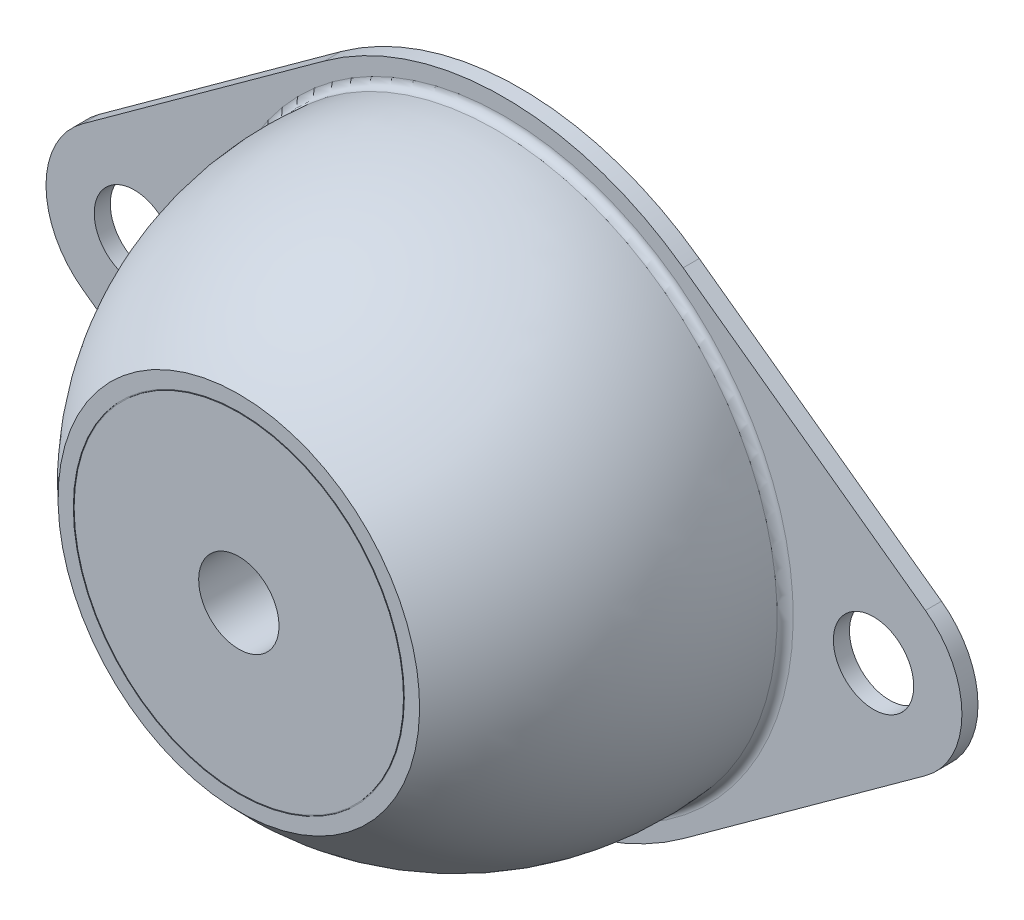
ISO-10303-21;
HEADER;
FILE_DESCRIPTION(('STEP AP214'),'2;1');
FILE_NAME('part.step','',(''),(''),'','','');
FILE_SCHEMA(('AUTOMOTIVE_DESIGN { 1 0 10303 214 1 1 1 1 }'));
ENDSEC;
DATA;
#1=APPLICATION_CONTEXT('core data for automotive mechanical design processes');
#2=APPLICATION_PROTOCOL_DEFINITION('international standard','automotive_design',2000,#1);
#3=PRODUCT_CONTEXT('',#1,'mechanical');
#4=PRODUCT('Part','Part','',(#3));
#5=PRODUCT_RELATED_PRODUCT_CATEGORY('part','',(#4));
#6=PRODUCT_DEFINITION_FORMATION('','',#4);
#7=PRODUCT_DEFINITION_CONTEXT('part definition',#1,'design');
#8=PRODUCT_DEFINITION('design','',#6,#7);
#9=PRODUCT_DEFINITION_SHAPE('','',#8);
#10=(LENGTH_UNIT() NAMED_UNIT(*) SI_UNIT(.MILLI.,.METRE.));
#11=(NAMED_UNIT(*) PLANE_ANGLE_UNIT() SI_UNIT($,.RADIAN.));
#12=(NAMED_UNIT(*) SI_UNIT($,.STERADIAN.) SOLID_ANGLE_UNIT());
#13=UNCERTAINTY_MEASURE_WITH_UNIT(LENGTH_MEASURE(1.E-05),#10,'distance_accuracy_value','');
#14=(GEOMETRIC_REPRESENTATION_CONTEXT(3) GLOBAL_UNCERTAINTY_ASSIGNED_CONTEXT((#13)) GLOBAL_UNIT_ASSIGNED_CONTEXT((#10,
#11,#12)) REPRESENTATION_CONTEXT('',''));
#15=CARTESIAN_POINT('',(0.,0.,0.));
#16=DIRECTION('',(0.,0.,1.));
#17=DIRECTION('',(1.,0.,0.));
#18=AXIS2_PLACEMENT_3D('',#15,#16,#17);
#19=CARTESIAN_POINT('',(0.,0.,2.));
#20=DIRECTION('',(0.,0.,1.));
#21=DIRECTION('',(0.,-1.,0.));
#22=AXIS2_PLACEMENT_3D('',#19,#20,#21);
#23=PLANE('',#22);
#24=DIRECTION('',(-0.809618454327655,-0.586956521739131,0.));
#25=VECTOR('',#24,1.);
#26=CARTESIAN_POINT('',(23.695652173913,30.7655012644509,2.));
#27=LINE('',#26,#25);
#28=CARTESIAN_POINT('',(23.695652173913,30.7655012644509,2.));
#29=VERTEX_POINT('',#28);
#30=CARTESIAN_POINT('',(-6.4565217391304,8.90580299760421,2.));
#31=VERTEX_POINT('',#30);
#32=EDGE_CURVE('E141',#29,#31,#27,.T.);
#33=ORIENTED_EDGE('',*,*,#32,.T.);
#34=CARTESIAN_POINT('',(0.,0.,2.));
#35=DIRECTION('',(0.,0.,1.));
#36=DIRECTION('',(1.,0.,0.));
#37=AXIS2_PLACEMENT_3D('',#34,#35,#36);
#38=CIRCLE('',#37,11.);
#39=CARTESIAN_POINT('',(-6.4565217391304,-8.90580299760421,2.));
#40=VERTEX_POINT('',#39);
#41=EDGE_CURVE('E74',#31,#40,#38,.T.);
#42=ORIENTED_EDGE('',*,*,#41,.T.);
#43=DIRECTION('',(0.809618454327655,-0.586956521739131,0.));
#44=VECTOR('',#43,1.);
#45=CARTESIAN_POINT('',(-6.4565217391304,-8.90580299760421,2.));
#46=LINE('',#45,#44);
#47=CARTESIAN_POINT('',(23.695652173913,-30.7655012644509,2.));
#48=VERTEX_POINT('',#47);
#49=EDGE_CURVE('E156',#40,#48,#46,.T.);
#50=ORIENTED_EDGE('',*,*,#49,.T.);
#51=CARTESIAN_POINT('',(46.,0.,2.));
#52=DIRECTION('',(0.,0.,1.));
#53=DIRECTION('',(1.,0.,0.));
#54=AXIS2_PLACEMENT_3D('',#51,#52,#53);
#55=CIRCLE('',#54,38.);
#56=CARTESIAN_POINT('',(68.3043478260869,-30.765501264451,2.));
#57=VERTEX_POINT('',#56);
#58=EDGE_CURVE('E169',#48,#57,#55,.T.);
#59=ORIENTED_EDGE('',*,*,#58,.T.);
#60=DIRECTION('',(0.809618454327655,0.586956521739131,0.));
#61=VECTOR('',#60,1.);
#62=CARTESIAN_POINT('',(68.304347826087,-30.7655012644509,2.));
#63=LINE('',#62,#61);
#64=CARTESIAN_POINT('',(98.4565217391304,-8.90580299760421,2.));
#65=VERTEX_POINT('',#64);
#66=EDGE_CURVE('E93',#57,#65,#63,.T.);
#67=ORIENTED_EDGE('',*,*,#66,.T.);
#68=CARTESIAN_POINT('',(92.,0.,2.));
#69=DIRECTION('',(0.,0.,1.));
#70=DIRECTION('',(1.,0.,0.));
#71=AXIS2_PLACEMENT_3D('',#68,#69,#70);
#72=CIRCLE('',#71,11.);
#73=CARTESIAN_POINT('',(98.4565217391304,8.90580299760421,2.));
#74=VERTEX_POINT('',#73);
#75=EDGE_CURVE('E87',#65,#74,#72,.T.);
#76=ORIENTED_EDGE('',*,*,#75,.T.);
#77=DIRECTION('',(-0.809618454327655,0.586956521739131,0.));
#78=VECTOR('',#77,1.);
#79=CARTESIAN_POINT('',(98.4565217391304,8.90580299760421,2.));
#80=LINE('',#79,#78);
#81=CARTESIAN_POINT('',(68.304347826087,30.7655012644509,2.));
#82=VERTEX_POINT('',#81);
#83=EDGE_CURVE('E91',#74,#82,#80,.T.);
#84=ORIENTED_EDGE('',*,*,#83,.T.);
#85=CARTESIAN_POINT('',(46.,0.,2.));
#86=DIRECTION('',(0.,0.,1.));
#87=DIRECTION('',(1.,0.,0.));
#88=AXIS2_PLACEMENT_3D('',#85,#86,#87);
#89=CIRCLE('',#88,38.);
#90=EDGE_CURVE('E31',#82,#29,#89,.T.);
#91=ORIENTED_EDGE('',*,*,#90,.T.);
#92=EDGE_LOOP('',(#33,#42,#50,#59,#67,#76,#84,#91));
#93=FACE_BOUND('',#92,.T.);
#94=CARTESIAN_POINT('',(92.,0.,2.));
#95=DIRECTION('',(0.,0.,1.));
#96=DIRECTION('',(1.,0.,0.));
#97=AXIS2_PLACEMENT_3D('',#94,#95,#96);
#98=CIRCLE('',#97,5.);
#99=CARTESIAN_POINT('',(97.,0.,2.));
#100=VERTEX_POINT('',#99);
#101=EDGE_CURVE('E107',#100,#100,#98,.T.);
#102=ORIENTED_EDGE('',*,*,#101,.F.);
#103=EDGE_LOOP('',(#102));
#104=FACE_BOUND('',#103,.T.);
#105=CARTESIAN_POINT('',(0.,0.,2.));
#106=DIRECTION('',(0.,0.,1.));
#107=DIRECTION('',(1.,0.,0.));
#108=AXIS2_PLACEMENT_3D('',#105,#106,#107);
#109=CIRCLE('',#108,5.);
#110=CARTESIAN_POINT('',(5.,0.,2.));
#111=VERTEX_POINT('',#110);
#112=EDGE_CURVE('E113',#111,#111,#109,.T.);
#113=ORIENTED_EDGE('',*,*,#112,.F.);
#114=EDGE_LOOP('',(#113));
#115=FACE_BOUND('',#114,.T.);
#116=CARTESIAN_POINT('',(46.,0.,2.));
#117=DIRECTION('',(0.,0.,-1.));
#118=DIRECTION('',(0.,1.,0.));
#119=AXIS2_PLACEMENT_3D('',#116,#117,#118);
#120=CIRCLE('',#119,36.);
#121=CARTESIAN_POINT('',(46.,36.,2.));
#122=VERTEX_POINT('',#121);
#123=EDGE_CURVE('E192',#122,#122,#120,.T.);
#124=ORIENTED_EDGE('',*,*,#123,.T.);
#125=EDGE_LOOP('',(#124));
#126=FACE_BOUND('',#125,.T.);
#127=ADVANCED_FACE('F14',(#93,#104,#115,#126),#23,.T.);
#128=CARTESIAN_POINT('',(23.695652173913,30.7655012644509,2.));
#129=DIRECTION('',(0.58695652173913,-0.809618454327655,0.));
#130=DIRECTION('',(0.809618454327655,0.58695652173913,0.));
#131=AXIS2_PLACEMENT_3D('',#128,#129,#130);
#132=PLANE('',#131);
#133=DIRECTION('',(-0.809618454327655,-0.586956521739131,0.));
#134=VECTOR('',#133,1.);
#135=CARTESIAN_POINT('',(23.695652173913,30.7655012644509,0.));
#136=LINE('',#135,#134);
#137=CARTESIAN_POINT('',(23.695652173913,30.7655012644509,0.));
#138=VERTEX_POINT('',#137);
#139=CARTESIAN_POINT('',(-6.4565217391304,8.90580299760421,0.));
#140=VERTEX_POINT('',#139);
#141=EDGE_CURVE('E117',#138,#140,#136,.T.);
#142=ORIENTED_EDGE('',*,*,#141,.T.);
#143=DIRECTION('',(0.,0.,-1.));
#144=VECTOR('',#143,1.);
#145=CARTESIAN_POINT('',(-6.4565217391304,8.90580299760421,2.));
#146=LINE('',#145,#144);
#147=EDGE_CURVE('E9',#31,#140,#146,.T.);
#148=ORIENTED_EDGE('',*,*,#147,.F.);
#149=ORIENTED_EDGE('',*,*,#32,.F.);
#150=DIRECTION('',(0.,0.,-1.));
#151=VECTOR('',#150,1.);
#152=CARTESIAN_POINT('',(23.695652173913,30.7655012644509,2.));
#153=LINE('',#152,#151);
#154=EDGE_CURVE('E116',#29,#138,#153,.T.);
#155=ORIENTED_EDGE('',*,*,#154,.T.);
#156=EDGE_LOOP('',(#142,#148,#149,#155));
#157=FACE_BOUND('',#156,.T.);
#158=ADVANCED_FACE('F16',(#157),#132,.F.);
#159=CARTESIAN_POINT('',(0.,0.,2.));
#160=DIRECTION('',(0.,0.,-1.));
#161=DIRECTION('',(0.,1.,0.));
#162=AXIS2_PLACEMENT_3D('',#159,#160,#161);
#163=CYLINDRICAL_SURFACE('',#162,11.);
#164=CARTESIAN_POINT('',(0.,0.,0.));
#165=DIRECTION('',(0.,0.,1.));
#166=DIRECTION('',(1.,0.,0.));
#167=AXIS2_PLACEMENT_3D('',#164,#165,#166);
#168=CIRCLE('',#167,11.);
#169=CARTESIAN_POINT('',(-6.4565217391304,-8.90580299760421,0.));
#170=VERTEX_POINT('',#169);
#171=EDGE_CURVE('E120',#140,#170,#168,.T.);
#172=ORIENTED_EDGE('',*,*,#171,.T.);
#173=DIRECTION('',(0.,0.,-1.));
#174=VECTOR('',#173,1.);
#175=CARTESIAN_POINT('',(-6.4565217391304,-8.90580299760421,2.));
#176=LINE('',#175,#174);
#177=EDGE_CURVE('E23',#40,#170,#176,.T.);
#178=ORIENTED_EDGE('',*,*,#177,.F.);
#179=ORIENTED_EDGE('',*,*,#41,.F.);
#180=ORIENTED_EDGE('',*,*,#147,.T.);
#181=EDGE_LOOP('',(#172,#178,#179,#180));
#182=FACE_BOUND('',#181,.T.);
#183=ADVANCED_FACE('F236',(#182),#163,.T.);
#184=CARTESIAN_POINT('',(-6.4565217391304,-8.90580299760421,2.));
#185=DIRECTION('',(0.586956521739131,0.809618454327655,0.));
#186=DIRECTION('',(-0.809618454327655,0.586956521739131,0.));
#187=AXIS2_PLACEMENT_3D('',#184,#185,#186);
#188=PLANE('',#187);
#189=DIRECTION('',(0.809618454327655,-0.586956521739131,0.));
#190=VECTOR('',#189,1.);
#191=CARTESIAN_POINT('',(-6.4565217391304,-8.90580299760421,0.));
#192=LINE('',#191,#190);
#193=CARTESIAN_POINT('',(23.695652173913,-30.7655012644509,0.));
#194=VERTEX_POINT('',#193);
#195=EDGE_CURVE('E123',#170,#194,#192,.T.);
#196=ORIENTED_EDGE('',*,*,#195,.T.);
#197=DIRECTION('',(0.,0.,-1.));
#198=VECTOR('',#197,1.);
#199=CARTESIAN_POINT('',(23.695652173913,-30.7655012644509,2.));
#200=LINE('',#199,#198);
#201=EDGE_CURVE('E148',#48,#194,#200,.T.);
#202=ORIENTED_EDGE('',*,*,#201,.F.);
#203=ORIENTED_EDGE('',*,*,#49,.F.);
#204=ORIENTED_EDGE('',*,*,#177,.T.);
#205=EDGE_LOOP('',(#196,#202,#203,#204));
#206=FACE_BOUND('',#205,.T.);
#207=ADVANCED_FACE('F154',(#206),#188,.F.);
#208=CARTESIAN_POINT('',(46.,0.,2.));
#209=DIRECTION('',(0.,0.,-1.));
#210=DIRECTION('',(0.,1.,0.));
#211=AXIS2_PLACEMENT_3D('',#208,#209,#210);
#212=CYLINDRICAL_SURFACE('',#211,38.);
#213=CARTESIAN_POINT('',(46.,0.,0.));
#214=DIRECTION('',(0.,0.,1.));
#215=DIRECTION('',(1.,0.,0.));
#216=AXIS2_PLACEMENT_3D('',#213,#214,#215);
#217=CIRCLE('',#216,38.);
#218=CARTESIAN_POINT('',(68.3043478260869,-30.765501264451,0.));
#219=VERTEX_POINT('',#218);
#220=EDGE_CURVE('E125',#194,#219,#217,.T.);
#221=ORIENTED_EDGE('',*,*,#220,.T.);
#222=DIRECTION('',(0.,0.,-1.));
#223=VECTOR('',#222,1.);
#224=CARTESIAN_POINT('',(68.3043478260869,-30.765501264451,2.));
#225=LINE('',#224,#223);
#226=EDGE_CURVE('E145',#57,#219,#225,.T.);
#227=ORIENTED_EDGE('',*,*,#226,.F.);
#228=ORIENTED_EDGE('',*,*,#58,.F.);
#229=ORIENTED_EDGE('',*,*,#201,.T.);
#230=EDGE_LOOP('',(#221,#227,#228,#229));
#231=FACE_BOUND('',#230,.T.);
#232=ADVANCED_FACE('F165',(#231),#212,.T.);
#233=CARTESIAN_POINT('',(68.304347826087,-30.7655012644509,2.));
#234=DIRECTION('',(-0.58695652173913,0.809618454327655,0.));
#235=DIRECTION('',(-0.809618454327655,-0.58695652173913,0.));
#236=AXIS2_PLACEMENT_3D('',#233,#234,#235);
#237=PLANE('',#236);
#238=DIRECTION('',(0.809618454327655,0.586956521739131,0.));
#239=VECTOR('',#238,1.);
#240=CARTESIAN_POINT('',(68.304347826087,-30.7655012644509,0.));
#241=LINE('',#240,#239);
#242=CARTESIAN_POINT('',(98.4565217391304,-8.90580299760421,0.));
#243=VERTEX_POINT('',#242);
#244=EDGE_CURVE('E127',#219,#243,#241,.T.);
#245=ORIENTED_EDGE('',*,*,#244,.T.);
#246=DIRECTION('',(0.,0.,-1.));
#247=VECTOR('',#246,1.);
#248=CARTESIAN_POINT('',(98.4565217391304,-8.90580299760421,2.));
#249=LINE('',#248,#247);
#250=EDGE_CURVE('E102',#65,#243,#249,.T.);
#251=ORIENTED_EDGE('',*,*,#250,.F.);
#252=ORIENTED_EDGE('',*,*,#66,.F.);
#253=ORIENTED_EDGE('',*,*,#226,.T.);
#254=EDGE_LOOP('',(#245,#251,#252,#253));
#255=FACE_BOUND('',#254,.T.);
#256=ADVANCED_FACE('F168',(#255),#237,.F.);
#257=CARTESIAN_POINT('',(92.,0.,2.));
#258=DIRECTION('',(0.,0.,-1.));
#259=DIRECTION('',(0.,1.,0.));
#260=AXIS2_PLACEMENT_3D('',#257,#258,#259);
#261=CYLINDRICAL_SURFACE('',#260,11.);
#262=CARTESIAN_POINT('',(92.,0.,0.));
#263=DIRECTION('',(0.,0.,1.));
#264=DIRECTION('',(1.,0.,0.));
#265=AXIS2_PLACEMENT_3D('',#262,#263,#264);
#266=CIRCLE('',#265,11.);
#267=CARTESIAN_POINT('',(98.4565217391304,8.90580299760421,0.));
#268=VERTEX_POINT('',#267);
#269=EDGE_CURVE('E101',#243,#268,#266,.T.);
#270=ORIENTED_EDGE('',*,*,#269,.T.);
#271=DIRECTION('',(0.,0.,-1.));
#272=VECTOR('',#271,1.);
#273=CARTESIAN_POINT('',(98.4565217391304,8.90580299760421,2.));
#274=LINE('',#273,#272);
#275=EDGE_CURVE('E98',#74,#268,#274,.T.);
#276=ORIENTED_EDGE('',*,*,#275,.F.);
#277=ORIENTED_EDGE('',*,*,#75,.F.);
#278=ORIENTED_EDGE('',*,*,#250,.T.);
#279=EDGE_LOOP('',(#270,#276,#277,#278));
#280=FACE_BOUND('',#279,.T.);
#281=ADVANCED_FACE('F99',(#280),#261,.T.);
#282=CARTESIAN_POINT('',(98.4565217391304,8.90580299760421,2.));
#283=DIRECTION('',(-0.586956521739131,-0.809618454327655,0.));
#284=DIRECTION('',(0.809618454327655,-0.586956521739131,0.));
#285=AXIS2_PLACEMENT_3D('',#282,#283,#284);
#286=PLANE('',#285);
#287=DIRECTION('',(-0.809618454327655,0.586956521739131,0.));
#288=VECTOR('',#287,1.);
#289=CARTESIAN_POINT('',(98.4565217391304,8.90580299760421,0.));
#290=LINE('',#289,#288);
#291=CARTESIAN_POINT('',(68.304347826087,30.7655012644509,0.));
#292=VERTEX_POINT('',#291);
#293=EDGE_CURVE('E60',#268,#292,#290,.T.);
#294=ORIENTED_EDGE('',*,*,#293,.T.);
#295=DIRECTION('',(0.,0.,-1.));
#296=VECTOR('',#295,1.);
#297=CARTESIAN_POINT('',(68.304347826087,30.7655012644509,2.));
#298=LINE('',#297,#296);
#299=EDGE_CURVE('E103',#82,#292,#298,.T.);
#300=ORIENTED_EDGE('',*,*,#299,.F.);
#301=ORIENTED_EDGE('',*,*,#83,.F.);
#302=ORIENTED_EDGE('',*,*,#275,.T.);
#303=EDGE_LOOP('',(#294,#300,#301,#302));
#304=FACE_BOUND('',#303,.T.);
#305=ADVANCED_FACE('F105',(#304),#286,.F.);
#306=CARTESIAN_POINT('',(92.,0.,2.));
#307=DIRECTION('',(0.,0.,-1.));
#308=DIRECTION('',(0.,1.,0.));
#309=AXIS2_PLACEMENT_3D('',#306,#307,#308);
#310=CYLINDRICAL_SURFACE('',#309,5.);
#311=ORIENTED_EDGE('',*,*,#101,.T.);
#312=EDGE_LOOP('',(#311));
#313=FACE_BOUND('',#312,.T.);
#314=CARTESIAN_POINT('',(92.,0.,0.));
#315=DIRECTION('',(0.,0.,1.));
#316=DIRECTION('',(1.,0.,0.));
#317=AXIS2_PLACEMENT_3D('',#314,#315,#316);
#318=CIRCLE('',#317,5.);
#319=CARTESIAN_POINT('',(97.,0.,0.));
#320=VERTEX_POINT('',#319);
#321=EDGE_CURVE('E132',#320,#320,#318,.T.);
#322=ORIENTED_EDGE('',*,*,#321,.F.);
#323=EDGE_LOOP('',(#322));
#324=FACE_BOUND('',#323,.T.);
#325=ADVANCED_FACE('F251',(#313,#324),#310,.F.);
#326=CARTESIAN_POINT('',(46.,0.,2.));
#327=DIRECTION('',(0.,0.,-1.));
#328=DIRECTION('',(0.,1.,0.));
#329=AXIS2_PLACEMENT_3D('',#326,#327,#328);
#330=CYLINDRICAL_SURFACE('',#329,22.5);
#331=CARTESIAN_POINT('',(46.,0.,11.5));
#332=DIRECTION('',(0.,0.,-1.));
#333=DIRECTION('',(0.,1.,0.));
#334=AXIS2_PLACEMENT_3D('',#331,#332,#333);
#335=CIRCLE('',#334,22.5);
#336=CARTESIAN_POINT('',(46.,22.5,11.5));
#337=VERTEX_POINT('',#336);
#338=EDGE_CURVE('E195',#337,#337,#335,.T.);
#339=ORIENTED_EDGE('',*,*,#338,.F.);
#340=EDGE_LOOP('',(#339));
#341=FACE_BOUND('',#340,.T.);
#342=CARTESIAN_POINT('',(46.,0.,0.));
#343=DIRECTION('',(0.,0.,1.));
#344=DIRECTION('',(1.,0.,0.));
#345=AXIS2_PLACEMENT_3D('',#342,#343,#344);
#346=CIRCLE('',#345,22.5);
#347=CARTESIAN_POINT('',(68.5,0.,0.));
#348=VERTEX_POINT('',#347);
#349=EDGE_CURVE('E135',#348,#348,#346,.T.);
#350=ORIENTED_EDGE('',*,*,#349,.F.);
#351=EDGE_LOOP('',(#350));
#352=FACE_BOUND('',#351,.T.);
#353=ADVANCED_FACE('F247',(#341,#352),#330,.F.);
#354=CARTESIAN_POINT('',(0.,0.,2.));
#355=DIRECTION('',(0.,0.,-1.));
#356=DIRECTION('',(0.,1.,0.));
#357=AXIS2_PLACEMENT_3D('',#354,#355,#356);
#358=CYLINDRICAL_SURFACE('',#357,5.);
#359=ORIENTED_EDGE('',*,*,#112,.T.);
#360=EDGE_LOOP('',(#359));
#361=FACE_BOUND('',#360,.T.);
#362=CARTESIAN_POINT('',(0.,0.,0.));
#363=DIRECTION('',(0.,0.,1.));
#364=DIRECTION('',(1.,0.,0.));
#365=AXIS2_PLACEMENT_3D('',#362,#363,#364);
#366=CIRCLE('',#365,5.);
#367=CARTESIAN_POINT('',(5.,0.,0.));
#368=VERTEX_POINT('',#367);
#369=EDGE_CURVE('E138',#368,#368,#366,.T.);
#370=ORIENTED_EDGE('',*,*,#369,.F.);
#371=EDGE_LOOP('',(#370));
#372=FACE_BOUND('',#371,.T.);
#373=ADVANCED_FACE('F244',(#361,#372),#358,.F.);
#374=CARTESIAN_POINT('',(46.,0.,2.));
#375=DIRECTION('',(0.,0.,-1.));
#376=DIRECTION('',(0.,1.,0.));
#377=AXIS2_PLACEMENT_3D('',#374,#375,#376);
#378=CYLINDRICAL_SURFACE('',#377,38.);
#379=CARTESIAN_POINT('',(46.,0.,0.));
#380=DIRECTION('',(0.,0.,1.));
#381=DIRECTION('',(1.,0.,0.));
#382=AXIS2_PLACEMENT_3D('',#379,#380,#381);
#383=CIRCLE('',#382,38.);
#384=EDGE_CURVE('E66',#292,#138,#383,.T.);
#385=ORIENTED_EDGE('',*,*,#384,.T.);
#386=ORIENTED_EDGE('',*,*,#154,.F.);
#387=ORIENTED_EDGE('',*,*,#90,.F.);
#388=ORIENTED_EDGE('',*,*,#299,.T.);
#389=EDGE_LOOP('',(#385,#386,#387,#388));
#390=FACE_BOUND('',#389,.T.);
#391=ADVANCED_FACE('F242',(#390),#378,.T.);
#392=CARTESIAN_POINT('',(0.,0.,0.));
#393=DIRECTION('',(0.,0.,1.));
#394=DIRECTION('',(0.,-1.,0.));
#395=AXIS2_PLACEMENT_3D('',#392,#393,#394);
#396=PLANE('',#395);
#397=ORIENTED_EDGE('',*,*,#349,.T.);
#398=EDGE_LOOP('',(#397));
#399=FACE_BOUND('',#398,.T.);
#400=ORIENTED_EDGE('',*,*,#141,.F.);
#401=ORIENTED_EDGE('',*,*,#384,.F.);
#402=ORIENTED_EDGE('',*,*,#293,.F.);
#403=ORIENTED_EDGE('',*,*,#269,.F.);
#404=ORIENTED_EDGE('',*,*,#244,.F.);
#405=ORIENTED_EDGE('',*,*,#220,.F.);
#406=ORIENTED_EDGE('',*,*,#195,.F.);
#407=ORIENTED_EDGE('',*,*,#171,.F.);
#408=EDGE_LOOP('',(#400,#401,#402,#403,#404,#405,#406,#407));
#409=FACE_BOUND('',#408,.T.);
#410=ORIENTED_EDGE('',*,*,#321,.T.);
#411=EDGE_LOOP('',(#410));
#412=FACE_BOUND('',#411,.T.);
#413=ORIENTED_EDGE('',*,*,#369,.T.);
#414=EDGE_LOOP('',(#413));
#415=FACE_BOUND('',#414,.T.);
#416=ADVANCED_FACE('F160',(#399,#409,#412,#415),#396,.F.);
#417=CARTESIAN_POINT('',(56.,0.,24.));
#418=DIRECTION('',(0.,0.,1.));
#419=DIRECTION('',(0.,-1.,0.));
#420=AXIS2_PLACEMENT_3D('',#417,#418,#419);
#421=PLANE('',#420);
#422=CARTESIAN_POINT('',(46.,0.,24.));
#423=DIRECTION('',(0.,0.,-1.));
#424=DIRECTION('',(0.,1.,0.));
#425=AXIS2_PLACEMENT_3D('',#422,#423,#424);
#426=CIRCLE('',#425,5.);
#427=CARTESIAN_POINT('',(46.,5.,24.));
#428=VERTEX_POINT('',#427);
#429=EDGE_CURVE('E204',#428,#428,#426,.T.);
#430=ORIENTED_EDGE('',*,*,#429,.F.);
#431=EDGE_LOOP('',(#430));
#432=FACE_BOUND('',#431,.T.);
#433=CARTESIAN_POINT('',(46.,0.,24.));
#434=DIRECTION('',(0.,0.,-1.));
#435=DIRECTION('',(0.,1.,0.));
#436=AXIS2_PLACEMENT_3D('',#433,#434,#435);
#437=CIRCLE('',#436,10.);
#438=CARTESIAN_POINT('',(46.,10.,24.));
#439=VERTEX_POINT('',#438);
#440=EDGE_CURVE('E201',#439,#439,#437,.T.);
#441=ORIENTED_EDGE('',*,*,#440,.T.);
#442=EDGE_LOOP('',(#441));
#443=FACE_BOUND('',#442,.T.);
#444=ADVANCED_FACE('F241',(#432,#443),#421,.F.);
#445=CARTESIAN_POINT('',(46.,0.,24.));
#446=DIRECTION('',(0.,0.,-1.));
#447=DIRECTION('',(0.,1.,0.));
#448=AXIS2_PLACEMENT_3D('',#445,#446,#447);
#449=TOROIDAL_SURFACE('',#448,11.,1.);
#450=CARTESIAN_POINT('',(46.,0.,23.));
#451=DIRECTION('',(0.,0.,-1.));
#452=DIRECTION('',(0.,1.,0.));
#453=AXIS2_PLACEMENT_3D('',#450,#451,#452);
#454=CIRCLE('',#453,11.);
#455=CARTESIAN_POINT('',(46.,11.,23.));
#456=VERTEX_POINT('',#455);
#457=EDGE_CURVE('E198',#456,#456,#454,.T.);
#458=ORIENTED_EDGE('',*,*,#457,.T.);
#459=EDGE_LOOP('',(#458));
#460=FACE_BOUND('',#459,.T.);
#461=ORIENTED_EDGE('',*,*,#440,.F.);
#462=EDGE_LOOP('',(#461));
#463=FACE_BOUND('',#462,.T.);
#464=ADVANCED_FACE('F227',(#460,#463),#449,.T.);
#465=CARTESIAN_POINT('',(46.,0.,11.5));
#466=DIRECTION('',(0.,0.,-1.));
#467=DIRECTION('',(0.,1.,0.));
#468=AXIS2_PLACEMENT_3D('',#465,#466,#467);
#469=DEGENERATE_TOROIDAL_SURFACE('',#468,11.,11.5,.T.);
#470=ORIENTED_EDGE('',*,*,#457,.F.);
#471=EDGE_LOOP('',(#470));
#472=FACE_BOUND('',#471,.T.);
#473=ORIENTED_EDGE('',*,*,#338,.T.);
#474=EDGE_LOOP('',(#473));
#475=FACE_BOUND('',#474,.T.);
#476=ADVANCED_FACE('F216',(#472,#475),#469,.F.);
#477=CARTESIAN_POINT('',(46.,0.,35.));
#478=DIRECTION('',(0.,0.,-1.));
#479=DIRECTION('',(0.,1.,0.));
#480=AXIS2_PLACEMENT_3D('',#477,#478,#479);
#481=PLANE('',#480);
#482=CARTESIAN_POINT('',(46.,0.,35.));
#483=DIRECTION('',(0.,0.,-1.));
#484=DIRECTION('',(0.,1.,0.));
#485=AXIS2_PLACEMENT_3D('',#482,#483,#484);
#486=CIRCLE('',#485,20.5);
#487=CARTESIAN_POINT('',(46.,20.5,35.));
#488=VERTEX_POINT('',#487);
#489=EDGE_CURVE('E121',#488,#488,#486,.T.);
#490=ORIENTED_EDGE('',*,*,#489,.F.);
#491=EDGE_LOOP('',(#490));
#492=FACE_BOUND('',#491,.T.);
#493=CARTESIAN_POINT('',(46.,0.,35.));
#494=DIRECTION('',(0.,0.,1.));
#495=DIRECTION('',(0.,-1.,0.));
#496=AXIS2_PLACEMENT_3D('',#493,#494,#495);
#497=CIRCLE('',#496,5.);
#498=CARTESIAN_POINT('',(46.,-5.,35.));
#499=VERTEX_POINT('',#498);
#500=EDGE_CURVE('E207',#499,#499,#497,.T.);
#501=ORIENTED_EDGE('',*,*,#500,.F.);
#502=EDGE_LOOP('',(#501));
#503=FACE_BOUND('',#502,.T.);
#504=ADVANCED_FACE('F213',(#492,#503),#481,.F.);
#505=CARTESIAN_POINT('',(46.,0.,24.));
#506=DIRECTION('',(0.,0.,-1.));
#507=DIRECTION('',(0.,1.,0.));
#508=AXIS2_PLACEMENT_3D('',#505,#506,#507);
#509=CYLINDRICAL_SURFACE('',#508,20.5);
#510=CARTESIAN_POINT('',(46.,0.,34.9));
#511=DIRECTION('',(0.,0.,-1.));
#512=DIRECTION('',(0.,1.,0.));
#513=AXIS2_PLACEMENT_3D('',#510,#511,#512);
#514=CIRCLE('',#513,20.5);
#515=CARTESIAN_POINT('',(46.,20.5,34.9));
#516=VERTEX_POINT('',#515);
#517=EDGE_CURVE('E177',#516,#516,#514,.T.);
#518=ORIENTED_EDGE('',*,*,#517,.F.);
#519=EDGE_LOOP('',(#518));
#520=FACE_BOUND('',#519,.T.);
#521=ORIENTED_EDGE('',*,*,#489,.T.);
#522=EDGE_LOOP('',(#521));
#523=FACE_BOUND('',#522,.T.);
#524=ADVANCED_FACE('F215',(#520,#523),#509,.T.);
#525=CARTESIAN_POINT('',(66.5,0.,34.9));
#526=DIRECTION('',(0.,0.,-1.));
#527=DIRECTION('',(0.,1.,0.));
#528=AXIS2_PLACEMENT_3D('',#525,#526,#527);
#529=PLANE('',#528);
#530=CARTESIAN_POINT('',(46.,0.,34.9));
#531=DIRECTION('',(0.,0.,-1.));
#532=DIRECTION('',(0.,1.,0.));
#533=AXIS2_PLACEMENT_3D('',#530,#531,#532);
#534=CIRCLE('',#533,20.6);
#535=CARTESIAN_POINT('',(46.,20.6,34.9));
#536=VERTEX_POINT('',#535);
#537=EDGE_CURVE('E180',#536,#536,#534,.T.);
#538=ORIENTED_EDGE('',*,*,#537,.F.);
#539=EDGE_LOOP('',(#538));
#540=FACE_BOUND('',#539,.T.);
#541=ORIENTED_EDGE('',*,*,#517,.T.);
#542=EDGE_LOOP('',(#541));
#543=FACE_BOUND('',#542,.T.);
#544=ADVANCED_FACE('F224',(#540,#543),#529,.F.);
#545=CARTESIAN_POINT('',(46.,0.,24.));
#546=DIRECTION('',(0.,0.,-1.));
#547=DIRECTION('',(0.,1.,0.));
#548=AXIS2_PLACEMENT_3D('',#545,#546,#547);
#549=CYLINDRICAL_SURFACE('',#548,20.6);
#550=CARTESIAN_POINT('',(46.,0.,35.));
#551=DIRECTION('',(0.,0.,-1.));
#552=DIRECTION('',(0.,1.,0.));
#553=AXIS2_PLACEMENT_3D('',#550,#551,#552);
#554=CIRCLE('',#553,20.6);
#555=CARTESIAN_POINT('',(46.,20.6,35.));
#556=VERTEX_POINT('',#555);
#557=EDGE_CURVE('E183',#556,#556,#554,.T.);
#558=ORIENTED_EDGE('',*,*,#557,.F.);
#559=EDGE_LOOP('',(#558));
#560=FACE_BOUND('',#559,.T.);
#561=ORIENTED_EDGE('',*,*,#537,.T.);
#562=EDGE_LOOP('',(#561));
#563=FACE_BOUND('',#562,.T.);
#564=ADVANCED_FACE('F356',(#560,#563),#549,.F.);
#565=CARTESIAN_POINT('',(66.6,0.,35.));
#566=DIRECTION('',(0.,0.,-1.));
#567=DIRECTION('',(0.,1.,0.));
#568=AXIS2_PLACEMENT_3D('',#565,#566,#567);
#569=PLANE('',#568);
#570=CARTESIAN_POINT('',(46.,0.,35.));
#571=DIRECTION('',(0.,0.,-1.));
#572=DIRECTION('',(0.,1.,0.));
#573=AXIS2_PLACEMENT_3D('',#570,#571,#572);
#574=CIRCLE('',#573,22.5);
#575=CARTESIAN_POINT('',(46.,22.5,35.));
#576=VERTEX_POINT('',#575);
#577=EDGE_CURVE('E186',#576,#576,#574,.T.);
#578=ORIENTED_EDGE('',*,*,#577,.F.);
#579=EDGE_LOOP('',(#578));
#580=FACE_BOUND('',#579,.T.);
#581=ORIENTED_EDGE('',*,*,#557,.T.);
#582=EDGE_LOOP('',(#581));
#583=FACE_BOUND('',#582,.T.);
#584=ADVANCED_FACE('F366',(#580,#583),#569,.F.);
#585=CARTESIAN_POINT('',(46.,0.,6.66692959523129));
#586=DIRECTION('',(0.,0.,-1.));
#587=DIRECTION('',(0.,1.,0.));
#588=AXIS2_PLACEMENT_3D('',#585,#586,#587);
#589=DEGENERATE_TOROIDAL_SURFACE('',#588,2.82266023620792,38.,.F.);
#590=ORIENTED_EDGE('',*,*,#577,.T.);
#591=EDGE_LOOP('',(#590));
#592=FACE_BOUND('',#591,.T.);
#593=CARTESIAN_POINT('',(46.,0.,3.00000000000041));
#594=DIRECTION('',(0.,0.,-1.));
#595=DIRECTION('',(0.,1.,0.));
#596=AXIS2_PLACEMENT_3D('',#593,#594,#595);
#597=CIRCLE('',#596,35.);
#598=CARTESIAN_POINT('',(46.,35.,3.00000000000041));
#599=VERTEX_POINT('',#598);
#600=EDGE_CURVE('E189',#599,#599,#597,.T.);
#601=ORIENTED_EDGE('',*,*,#600,.F.);
#602=EDGE_LOOP('',(#601));
#603=FACE_BOUND('',#602,.T.);
#604=ADVANCED_FACE('F377',(#592,#603),#589,.F.);
#605=CARTESIAN_POINT('',(46.,0.,3.));
#606=DIRECTION('',(0.,0.,-1.));
#607=DIRECTION('',(0.,1.,0.));
#608=AXIS2_PLACEMENT_3D('',#605,#606,#607);
#609=TOROIDAL_SURFACE('',#608,36.,1.);
#610=ORIENTED_EDGE('',*,*,#123,.F.);
#611=EDGE_LOOP('',(#610));
#612=FACE_BOUND('',#611,.T.);
#613=ORIENTED_EDGE('',*,*,#600,.T.);
#614=EDGE_LOOP('',(#613));
#615=FACE_BOUND('',#614,.T.);
#616=ADVANCED_FACE('F388',(#612,#615),#609,.F.);
#617=CARTESIAN_POINT('',(46.,0.,0.));
#618=DIRECTION('',(0.,0.,1.));
#619=DIRECTION('',(0.,-1.,0.));
#620=AXIS2_PLACEMENT_3D('',#617,#618,#619);
#621=CYLINDRICAL_SURFACE('',#620,5.);
#622=ORIENTED_EDGE('',*,*,#429,.T.);
#623=EDGE_LOOP('',(#622));
#624=FACE_BOUND('',#623,.T.);
#625=ORIENTED_EDGE('',*,*,#500,.T.);
#626=EDGE_LOOP('',(#625));
#627=FACE_BOUND('',#626,.T.);
#628=ADVANCED_FACE('F211',(#624,#627),#621,.F.);
#629=CLOSED_SHELL('',(#127,#158,#183,#207,#232,#256,#281,#305,#325,#353,#373,#391,#416,#444,
#464,#476,#504,#524,#544,#564,#584,#604,#616,#628));
#630=MANIFOLD_SOLID_BREP('B1',#629);
#631=ADVANCED_BREP_SHAPE_REPRESENTATION('',(#18,#630),#14);
#632=SHAPE_DEFINITION_REPRESENTATION(#9,#631);
ENDSEC;
END-ISO-10303-21;
